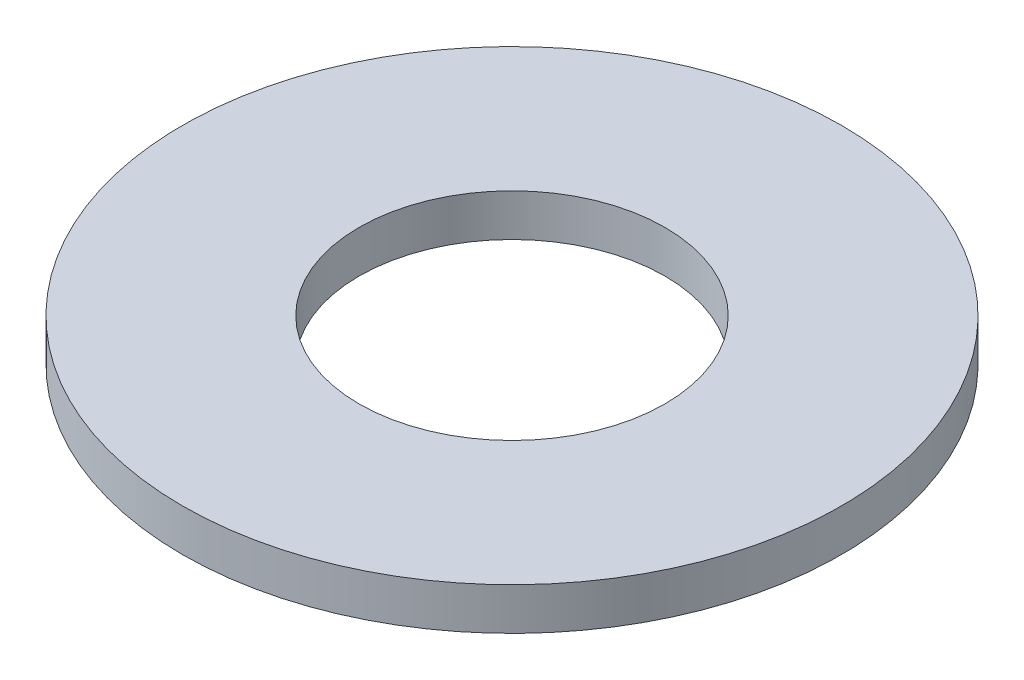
from build123d import *

# Parameters (mm, degrees)
SKETCH1_R           = 4.7625
BOSS_EXTRUDE1_DEPTH = 0.6096
SKETCH5_R           = 2.2098
CUT_EXTRUDE1_DEPTH  = 7.762723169


with BuildPart() as part:
    # Sketch1 → Boss-Extrude1 (new body)
    with BuildSketch(Plane(origin=(0, 0, 0), x_dir=(1, 0, 0), z_dir=(0, 1, 0))):
        with Locations(Location((0, 0, 0), (0, 0, 270))):
            Circle(SKETCH1_R)
    extrude(amount=BOSS_EXTRUDE1_DEPTH)

    # Sketch5 → Cut-Extrude1 (cut, through all)
    with BuildSketch(Plane(origin=(0, 0.6096, 0), x_dir=(-1, 0, 0), z_dir=(0, 1, 0))):
        with Locations(Location((0, 0, 0), (0, 0, 90))):
            Circle(SKETCH5_R)
    extrude(amount=-CUT_EXTRUDE1_DEPTH, mode=Mode.SUBTRACT)


solid = part.part
